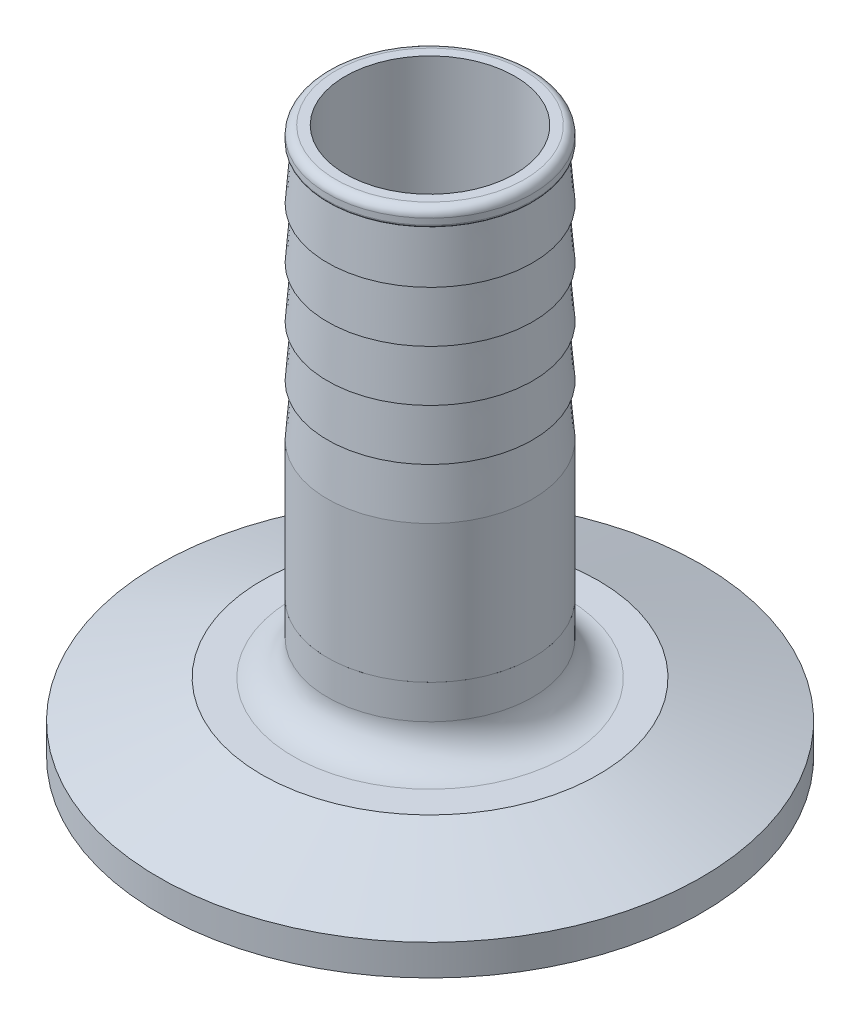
ISO-10303-21;
HEADER;
FILE_DESCRIPTION(('STEP AP214'),'2;1');
FILE_NAME('part.step','',(''),(''),'','','');
FILE_SCHEMA(('AUTOMOTIVE_DESIGN { 1 0 10303 214 1 1 1 1 }'));
ENDSEC;
DATA;
#1=APPLICATION_CONTEXT('core data for automotive mechanical design processes');
#2=APPLICATION_PROTOCOL_DEFINITION('international standard','automotive_design',2000,#1);
#3=PRODUCT_CONTEXT('',#1,'mechanical');
#4=PRODUCT('Part','Part','',(#3));
#5=PRODUCT_RELATED_PRODUCT_CATEGORY('part','',(#4));
#6=PRODUCT_DEFINITION_FORMATION('','',#4);
#7=PRODUCT_DEFINITION_CONTEXT('part definition',#1,'design');
#8=PRODUCT_DEFINITION('design','',#6,#7);
#9=PRODUCT_DEFINITION_SHAPE('','',#8);
#10=(LENGTH_UNIT() NAMED_UNIT(*) SI_UNIT(.MILLI.,.METRE.));
#11=(NAMED_UNIT(*) PLANE_ANGLE_UNIT() SI_UNIT($,.RADIAN.));
#12=(NAMED_UNIT(*) SI_UNIT($,.STERADIAN.) SOLID_ANGLE_UNIT());
#13=UNCERTAINTY_MEASURE_WITH_UNIT(LENGTH_MEASURE(1.E-05),#10,'distance_accuracy_value','');
#14=(GEOMETRIC_REPRESENTATION_CONTEXT(3) GLOBAL_UNCERTAINTY_ASSIGNED_CONTEXT((#13)) GLOBAL_UNIT_ASSIGNED_CONTEXT((#10,
#11,#12)) REPRESENTATION_CONTEXT('',''));
#15=CARTESIAN_POINT('',(0.,0.,0.));
#16=DIRECTION('',(0.,0.,1.));
#17=DIRECTION('',(1.,0.,0.));
#18=AXIS2_PLACEMENT_3D('',#15,#16,#17);
#19=CARTESIAN_POINT('',(32.9073264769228,33.0709293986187,40.1985314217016));
#20=DIRECTION('',(0.,-1.,0.));
#21=DIRECTION('',(-0.0101854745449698,0.,-0.999948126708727));
#22=AXIS2_PLACEMENT_3D('',#19,#20,#21);
#23=PLANE('',#22);
#24=CARTESIAN_POINT('',(23.3828206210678,33.0709293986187,40.2955480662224));
#25=DIRECTION('',(0.,-1.,0.));
#26=DIRECTION('',(-0.0101854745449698,0.,-0.999948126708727));
#27=AXIS2_PLACEMENT_3D('',#24,#25,#26);
#28=CIRCLE('',#27,7.874);
#29=CARTESIAN_POINT('',(23.3026201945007,33.0709293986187,32.4219565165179));
#30=VERTEX_POINT('',#29);
#31=EDGE_CURVE('P0_E67',#30,#30,#28,.T.);
#32=ORIENTED_EDGE('',*,*,#31,.F.);
#33=EDGE_LOOP('',(#32));
#34=FACE_BOUND('',#33,.T.);
#35=CARTESIAN_POINT('',(23.3828206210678,33.0709293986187,40.2955480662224));
#36=DIRECTION('',(0.,-1.,0.));
#37=DIRECTION('',(-0.0101854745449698,0.,-0.999948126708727));
#38=AXIS2_PLACEMENT_3D('',#35,#36,#37);
#39=CIRCLE('',#38,9.52499994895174);
#40=CARTESIAN_POINT('',(23.2858039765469,33.0709293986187,30.7710422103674));
#41=VERTEX_POINT('',#40);
#42=EDGE_CURVE('P0_E9',#41,#41,#39,.T.);
#43=ORIENTED_EDGE('',*,*,#42,.T.);
#44=EDGE_LOOP('',(#43));
#45=FACE_BOUND('',#44,.T.);
#46=ADVANCED_FACE('P0_F14',(#34,#45),#23,.T.);
#47=CARTESIAN_POINT('',(23.3828206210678,33.0709293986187,40.2955480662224));
#48=DIRECTION('',(0.,-1.,0.));
#49=DIRECTION('',(-0.0101854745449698,0.,-0.999948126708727));
#50=AXIS2_PLACEMENT_3D('',#47,#48,#49);
#51=CYLINDRICAL_SURFACE('',#50,9.52499994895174);
#52=CARTESIAN_POINT('',(23.3828206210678,45.8471293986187,40.2955480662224));
#53=DIRECTION('',(0.,-1.,0.));
#54=DIRECTION('',(-0.0101854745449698,0.,-0.999948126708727));
#55=AXIS2_PLACEMENT_3D('',#52,#53,#54);
#56=CIRCLE('',#55,9.52499994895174);
#57=CARTESIAN_POINT('',(23.2858039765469,45.8471293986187,30.7710422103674));
#58=VERTEX_POINT('',#57);
#59=EDGE_CURVE('P0_E20',#58,#58,#56,.T.);
#60=ORIENTED_EDGE('',*,*,#59,.T.);
#61=EDGE_LOOP('',(#60));
#62=FACE_BOUND('',#61,.T.);
#63=ORIENTED_EDGE('',*,*,#42,.F.);
#64=EDGE_LOOP('',(#63));
#65=FACE_BOUND('',#64,.T.);
#66=ADVANCED_FACE('P0_F83',(#62,#65),#51,.T.);
#67=CARTESIAN_POINT('',(23.3828206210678,45.8471293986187,40.2955480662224));
#68=DIRECTION('',(0.,-1.,0.));
#69=DIRECTION('',(-0.0101854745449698,0.,-0.999948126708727));
#70=AXIS2_PLACEMENT_3D('',#67,#68,#69);
#71=CONICAL_SURFACE('',#70,9.52499994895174,0.0800425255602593);
#72=CARTESIAN_POINT('',(23.3828206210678,50.5969293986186,40.2955480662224));
#73=DIRECTION('',(0.,-1.,0.));
#74=DIRECTION('',(-0.0101854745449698,0.,-0.999948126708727));
#75=AXIS2_PLACEMENT_3D('',#72,#73,#74);
#76=CIRCLE('',#75,9.14399994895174);
#77=CARTESIAN_POINT('',(23.2896846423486,50.5969293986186,31.1520224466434));
#78=VERTEX_POINT('',#77);
#79=EDGE_CURVE('P0_E24',#78,#78,#76,.T.);
#80=ORIENTED_EDGE('',*,*,#79,.T.);
#81=EDGE_LOOP('',(#80));
#82=FACE_BOUND('',#81,.T.);
#83=ORIENTED_EDGE('',*,*,#59,.F.);
#84=EDGE_LOOP('',(#83));
#85=FACE_BOUND('',#84,.T.);
#86=ADVANCED_FACE('P0_F88',(#82,#85),#71,.T.);
#87=CARTESIAN_POINT('',(32.9073264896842,50.5969293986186,40.1985314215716));
#88=DIRECTION('',(0.,-1.,0.));
#89=DIRECTION('',(-0.0101854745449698,0.,-0.999948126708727));
#90=AXIS2_PLACEMENT_3D('',#87,#88,#89);
#91=PLANE('',#90);
#92=CARTESIAN_POINT('',(23.3828206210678,50.5969293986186,40.2955480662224));
#93=DIRECTION('',(0.,-1.,0.));
#94=DIRECTION('',(-0.0101854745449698,0.,-0.999948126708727));
#95=AXIS2_PLACEMENT_3D('',#92,#93,#94);
#96=CIRCLE('',#95,9.5249999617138);
#97=CARTESIAN_POINT('',(23.285803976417,50.5969293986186,30.771042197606));
#98=VERTEX_POINT('',#97);
#99=EDGE_CURVE('P0_E28',#98,#98,#96,.T.);
#100=ORIENTED_EDGE('',*,*,#99,.T.);
#101=EDGE_LOOP('',(#100));
#102=FACE_BOUND('',#101,.T.);
#103=ORIENTED_EDGE('',*,*,#79,.F.);
#104=EDGE_LOOP('',(#103));
#105=FACE_BOUND('',#104,.T.);
#106=ADVANCED_FACE('P0_F92',(#102,#105),#91,.T.);
#107=CARTESIAN_POINT('',(23.3828206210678,50.5969293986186,40.2955480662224));
#108=DIRECTION('',(0.,-1.,0.));
#109=DIRECTION('',(-0.0101854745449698,0.,-0.999948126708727));
#110=AXIS2_PLACEMENT_3D('',#107,#108,#109);
#111=CONICAL_SURFACE('',#110,9.5249999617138,0.0800425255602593);
#112=CARTESIAN_POINT('',(23.3828206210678,55.3467293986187,40.2955480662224));
#113=DIRECTION('',(0.,-1.,0.));
#114=DIRECTION('',(-0.0101854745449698,0.,-0.999948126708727));
#115=AXIS2_PLACEMENT_3D('',#112,#113,#114);
#116=CIRCLE('',#115,9.1439999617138);
#117=CARTESIAN_POINT('',(23.2896846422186,55.3467293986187,31.1520224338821));
#118=VERTEX_POINT('',#117);
#119=EDGE_CURVE('P0_E33',#118,#118,#116,.T.);
#120=ORIENTED_EDGE('',*,*,#119,.T.);
#121=EDGE_LOOP('',(#120));
#122=FACE_BOUND('',#121,.T.);
#123=ORIENTED_EDGE('',*,*,#99,.F.);
#124=EDGE_LOOP('',(#123));
#125=FACE_BOUND('',#124,.T.);
#126=ADVANCED_FACE('P0_F99',(#122,#125),#111,.T.);
#127=CARTESIAN_POINT('',(32.9073265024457,55.3467293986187,40.1985314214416));
#128=DIRECTION('',(0.,-1.,0.));
#129=DIRECTION('',(-0.0101854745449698,0.,-0.999948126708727));
#130=AXIS2_PLACEMENT_3D('',#127,#128,#129);
#131=PLANE('',#130);
#132=CARTESIAN_POINT('',(23.3828206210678,55.3467293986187,40.2955480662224));
#133=DIRECTION('',(0.,-1.,0.));
#134=DIRECTION('',(-0.0101854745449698,0.,-0.999948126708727));
#135=AXIS2_PLACEMENT_3D('',#132,#133,#134);
#136=CIRCLE('',#135,9.52499997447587);
#137=CARTESIAN_POINT('',(23.285803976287,55.3467293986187,30.7710421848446));
#138=VERTEX_POINT('',#137);
#139=EDGE_CURVE('P0_E36',#138,#138,#136,.T.);
#140=ORIENTED_EDGE('',*,*,#139,.T.);
#141=EDGE_LOOP('',(#140));
#142=FACE_BOUND('',#141,.T.);
#143=ORIENTED_EDGE('',*,*,#119,.F.);
#144=EDGE_LOOP('',(#143));
#145=FACE_BOUND('',#144,.T.);
#146=ADVANCED_FACE('P0_F103',(#142,#145),#131,.T.);
#147=CARTESIAN_POINT('',(23.3828206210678,55.3467293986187,40.2955480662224));
#148=DIRECTION('',(0.,-1.,0.));
#149=DIRECTION('',(-0.0101854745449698,0.,-0.999948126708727));
#150=AXIS2_PLACEMENT_3D('',#147,#148,#149);
#151=CONICAL_SURFACE('',#150,9.52499997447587,0.0800425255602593);
#152=CARTESIAN_POINT('',(23.3828206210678,60.0965293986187,40.2955480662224));
#153=DIRECTION('',(0.,-1.,0.));
#154=DIRECTION('',(-0.0101854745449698,0.,-0.999948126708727));
#155=AXIS2_PLACEMENT_3D('',#152,#153,#154);
#156=CIRCLE('',#155,9.14399997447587);
#157=CARTESIAN_POINT('',(23.2896846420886,60.0965293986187,31.1520224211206));
#158=VERTEX_POINT('',#157);
#159=EDGE_CURVE('P0_E39',#158,#158,#156,.T.);
#160=ORIENTED_EDGE('',*,*,#159,.T.);
#161=EDGE_LOOP('',(#160));
#162=FACE_BOUND('',#161,.T.);
#163=ORIENTED_EDGE('',*,*,#139,.F.);
#164=EDGE_LOOP('',(#163));
#165=FACE_BOUND('',#164,.T.);
#166=ADVANCED_FACE('P0_F107',(#162,#165),#151,.T.);
#167=CARTESIAN_POINT('',(32.9073265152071,60.0965293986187,40.1985314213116));
#168=DIRECTION('',(0.,-1.,0.));
#169=DIRECTION('',(-0.0101854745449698,0.,-0.999948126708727));
#170=AXIS2_PLACEMENT_3D('',#167,#168,#169);
#171=PLANE('',#170);
#172=CARTESIAN_POINT('',(23.3828206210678,60.0965293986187,40.2955480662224));
#173=DIRECTION('',(0.,-1.,0.));
#174=DIRECTION('',(-0.0101854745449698,0.,-0.999948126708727));
#175=AXIS2_PLACEMENT_3D('',#172,#173,#174);
#176=CIRCLE('',#175,9.52499998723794);
#177=CARTESIAN_POINT('',(23.285803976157,60.0965293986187,30.7710421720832));
#178=VERTEX_POINT('',#177);
#179=EDGE_CURVE('P0_E42',#178,#178,#176,.T.);
#180=ORIENTED_EDGE('',*,*,#179,.T.);
#181=EDGE_LOOP('',(#180));
#182=FACE_BOUND('',#181,.T.);
#183=ORIENTED_EDGE('',*,*,#159,.F.);
#184=EDGE_LOOP('',(#183));
#185=FACE_BOUND('',#184,.T.);
#186=ADVANCED_FACE('P0_F111',(#182,#185),#171,.T.);
#187=CARTESIAN_POINT('',(23.3828206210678,60.0965293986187,40.2955480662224));
#188=DIRECTION('',(0.,-1.,0.));
#189=DIRECTION('',(-0.0101854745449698,0.,-0.999948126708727));
#190=AXIS2_PLACEMENT_3D('',#187,#188,#189);
#191=CONICAL_SURFACE('',#190,9.52499998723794,0.0800425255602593);
#192=CARTESIAN_POINT('',(23.3828206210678,64.8463293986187,40.2955480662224));
#193=DIRECTION('',(0.,-1.,0.));
#194=DIRECTION('',(-0.0101854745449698,0.,-0.999948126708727));
#195=AXIS2_PLACEMENT_3D('',#192,#193,#194);
#196=CIRCLE('',#195,9.14399998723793);
#197=CARTESIAN_POINT('',(23.2896846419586,64.8463293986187,31.1520224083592));
#198=VERTEX_POINT('',#197);
#199=EDGE_CURVE('P0_E45',#198,#198,#196,.T.);
#200=ORIENTED_EDGE('',*,*,#199,.T.);
#201=EDGE_LOOP('',(#200));
#202=FACE_BOUND('',#201,.T.);
#203=ORIENTED_EDGE('',*,*,#179,.F.);
#204=EDGE_LOOP('',(#203));
#205=FACE_BOUND('',#204,.T.);
#206=ADVANCED_FACE('P0_F115',(#202,#205),#191,.T.);
#207=CARTESIAN_POINT('',(32.9073265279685,64.8463293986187,40.1985314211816));
#208=DIRECTION('',(0.,-1.,0.));
#209=DIRECTION('',(-0.0101854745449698,0.,-0.999948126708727));
#210=AXIS2_PLACEMENT_3D('',#207,#208,#209);
#211=PLANE('',#210);
#212=CARTESIAN_POINT('',(23.3828206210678,64.8463293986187,40.2955480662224));
#213=DIRECTION('',(0.,-1.,0.));
#214=DIRECTION('',(-0.0101854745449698,0.,-0.999948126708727));
#215=AXIS2_PLACEMENT_3D('',#212,#213,#214);
#216=CIRCLE('',#215,9.525);
#217=CARTESIAN_POINT('',(23.285803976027,64.8463293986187,30.7710421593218));
#218=VERTEX_POINT('',#217);
#219=EDGE_CURVE('P0_E48',#218,#218,#216,.T.);
#220=ORIENTED_EDGE('',*,*,#219,.T.);
#221=EDGE_LOOP('',(#220));
#222=FACE_BOUND('',#221,.T.);
#223=ORIENTED_EDGE('',*,*,#199,.F.);
#224=EDGE_LOOP('',(#223));
#225=FACE_BOUND('',#224,.T.);
#226=ADVANCED_FACE('P0_F119',(#222,#225),#211,.T.);
#227=CARTESIAN_POINT('',(23.3828206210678,64.8463293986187,40.2955480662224));
#228=DIRECTION('',(0.,-1.,0.));
#229=DIRECTION('',(-0.0101854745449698,0.,-0.999948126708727));
#230=AXIS2_PLACEMENT_3D('',#227,#228,#229);
#231=CONICAL_SURFACE('',#230,9.525,0.0800425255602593);
#232=CARTESIAN_POINT('',(23.3828206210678,69.5961293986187,40.2955480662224));
#233=DIRECTION('',(0.,-1.,0.));
#234=DIRECTION('',(-0.0101854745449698,0.,-0.999948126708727));
#235=AXIS2_PLACEMENT_3D('',#232,#233,#234);
#236=CIRCLE('',#235,9.144);
#237=CARTESIAN_POINT('',(23.2896846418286,69.5961293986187,31.1520223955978));
#238=VERTEX_POINT('',#237);
#239=EDGE_CURVE('P0_E51',#238,#238,#236,.T.);
#240=ORIENTED_EDGE('',*,*,#239,.T.);
#241=EDGE_LOOP('',(#240));
#242=FACE_BOUND('',#241,.T.);
#243=ORIENTED_EDGE('',*,*,#219,.F.);
#244=EDGE_LOOP('',(#243));
#245=FACE_BOUND('',#244,.T.);
#246=ADVANCED_FACE('P0_F123',(#242,#245),#231,.T.);
#247=CARTESIAN_POINT('',(32.6533397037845,69.5961293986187,40.201118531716));
#248=DIRECTION('',(0.,-1.,0.));
#249=DIRECTION('',(-0.0101854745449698,0.,-0.999948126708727));
#250=AXIS2_PLACEMENT_3D('',#247,#248,#249);
#251=PLANE('',#250);
#252=CARTESIAN_POINT('',(23.3828206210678,69.5961293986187,40.2955480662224));
#253=DIRECTION('',(0.,-1.,0.));
#254=DIRECTION('',(-0.0101854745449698,0.,-0.999948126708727));
#255=AXIS2_PLACEMENT_3D('',#252,#253,#254);
#256=CIRCLE('',#255,9.27100000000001);
#257=CARTESIAN_POINT('',(23.2883910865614,69.5961293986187,31.0250289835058));
#258=VERTEX_POINT('',#257);
#259=EDGE_CURVE('P0_E54',#258,#258,#256,.T.);
#260=ORIENTED_EDGE('',*,*,#259,.T.);
#261=EDGE_LOOP('',(#260));
#262=FACE_BOUND('',#261,.T.);
#263=ORIENTED_EDGE('',*,*,#239,.F.);
#264=EDGE_LOOP('',(#263));
#265=FACE_BOUND('',#264,.T.);
#266=ADVANCED_FACE('P0_F127',(#262,#265),#251,.T.);
#267=CARTESIAN_POINT('',(23.3828206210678,69.8501293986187,40.2955480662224));
#268=DIRECTION('',(0.,-1.,0.));
#269=DIRECTION('',(-0.0101854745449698,0.,-0.999948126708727));
#270=AXIS2_PLACEMENT_3D('',#267,#268,#269);
#271=TOROIDAL_SURFACE('',#270,9.271,0.253999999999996);
#272=CARTESIAN_POINT('',(23.3828206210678,69.8501293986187,40.2955480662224));
#273=DIRECTION('',(0.,-1.,0.));
#274=DIRECTION('',(-0.0101854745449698,0.,-0.999948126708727));
#275=AXIS2_PLACEMENT_3D('',#272,#273,#274);
#276=CIRCLE('',#275,9.52499999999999);
#277=CARTESIAN_POINT('',(23.285803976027,69.8501293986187,30.7710421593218));
#278=VERTEX_POINT('',#277);
#279=EDGE_CURVE('P0_E57',#278,#278,#276,.T.);
#280=ORIENTED_EDGE('',*,*,#279,.T.);
#281=EDGE_LOOP('',(#280));
#282=FACE_BOUND('',#281,.T.);
#283=ORIENTED_EDGE('',*,*,#259,.F.);
#284=EDGE_LOOP('',(#283));
#285=FACE_BOUND('',#284,.T.);
#286=ADVANCED_FACE('P0_F131',(#282,#285),#271,.T.);
#287=CARTESIAN_POINT('',(23.3828206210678,33.0709293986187,40.2955480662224));
#288=DIRECTION('',(0.,-1.,0.));
#289=DIRECTION('',(-0.0101854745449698,0.,-0.999948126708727));
#290=AXIS2_PLACEMENT_3D('',#287,#288,#289);
#291=CYLINDRICAL_SURFACE('',#290,9.525);
#292=CARTESIAN_POINT('',(23.3828206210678,70.4089293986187,40.2955480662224));
#293=DIRECTION('',(0.,-1.,0.));
#294=DIRECTION('',(-0.0101854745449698,0.,-0.999948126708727));
#295=AXIS2_PLACEMENT_3D('',#292,#293,#294);
#296=CIRCLE('',#295,9.525);
#297=CARTESIAN_POINT('',(23.285803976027,70.4089293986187,30.7710421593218));
#298=VERTEX_POINT('',#297);
#299=EDGE_CURVE('P0_E60',#298,#298,#296,.T.);
#300=ORIENTED_EDGE('',*,*,#299,.T.);
#301=EDGE_LOOP('',(#300));
#302=FACE_BOUND('',#301,.T.);
#303=ORIENTED_EDGE('',*,*,#279,.F.);
#304=EDGE_LOOP('',(#303));
#305=FACE_BOUND('',#304,.T.);
#306=ADVANCED_FACE('P0_F135',(#302,#305),#291,.T.);
#307=CARTESIAN_POINT('',(23.3828206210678,70.4089293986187,40.2955480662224));
#308=DIRECTION('',(0.,-1.,0.));
#309=DIRECTION('',(-0.0101854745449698,0.,-0.999948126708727));
#310=AXIS2_PLACEMENT_3D('',#307,#308,#309);
#311=TOROIDAL_SURFACE('',#310,8.763,0.762000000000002);
#312=CARTESIAN_POINT('',(23.3828206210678,71.1709293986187,40.2955480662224));
#313=DIRECTION('',(0.,-1.,0.));
#314=DIRECTION('',(-0.0101854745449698,0.,-0.999948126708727));
#315=AXIS2_PLACEMENT_3D('',#312,#313,#314);
#316=CIRCLE('',#315,8.763);
#317=CARTESIAN_POINT('',(23.2935653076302,71.1709293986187,31.5330026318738));
#318=VERTEX_POINT('',#317);
#319=EDGE_CURVE('P0_E63',#318,#318,#316,.T.);
#320=ORIENTED_EDGE('',*,*,#319,.T.);
#321=EDGE_LOOP('',(#320));
#322=FACE_BOUND('',#321,.T.);
#323=ORIENTED_EDGE('',*,*,#299,.F.);
#324=EDGE_LOOP('',(#323));
#325=FACE_BOUND('',#324,.T.);
#326=ADVANCED_FACE('P0_F139',(#322,#325),#311,.T.);
#327=CARTESIAN_POINT('',(23.3828206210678,71.1709293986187,40.2955480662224));
#328=DIRECTION('',(0.,1.,0.));
#329=DIRECTION('',(0.0101854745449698,0.,0.999948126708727));
#330=AXIS2_PLACEMENT_3D('',#327,#328,#329);
#331=PLANE('',#330);
#332=CARTESIAN_POINT('',(23.3828206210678,71.1709293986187,40.2955480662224));
#333=DIRECTION('',(0.,-1.,0.));
#334=DIRECTION('',(-0.0101854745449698,0.,-0.999948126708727));
#335=AXIS2_PLACEMENT_3D('',#332,#333,#334);
#336=CIRCLE('',#335,7.874);
#337=CARTESIAN_POINT('',(23.3026201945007,71.1709293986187,32.4219565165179));
#338=VERTEX_POINT('',#337);
#339=EDGE_CURVE('P0_E66',#338,#338,#336,.T.);
#340=ORIENTED_EDGE('',*,*,#339,.T.);
#341=EDGE_LOOP('',(#340));
#342=FACE_BOUND('',#341,.T.);
#343=ORIENTED_EDGE('',*,*,#319,.F.);
#344=EDGE_LOOP('',(#343));
#345=FACE_BOUND('',#344,.T.);
#346=ADVANCED_FACE('P0_F73',(#342,#345),#331,.T.);
#347=CARTESIAN_POINT('',(23.3828206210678,71.1709293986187,40.2955480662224));
#348=DIRECTION('',(0.,-1.,0.));
#349=DIRECTION('',(-0.0101854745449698,0.,-0.999948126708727));
#350=AXIS2_PLACEMENT_3D('',#347,#348,#349);
#351=CYLINDRICAL_SURFACE('',#350,7.874);
#352=ORIENTED_EDGE('',*,*,#339,.F.);
#353=EDGE_LOOP('',(#352));
#354=FACE_BOUND('',#353,.T.);
#355=ORIENTED_EDGE('',*,*,#31,.T.);
#356=EDGE_LOOP('',(#355));
#357=FACE_BOUND('',#356,.T.);
#358=ADVANCED_FACE('P0_F76',(#354,#357),#351,.F.);
#359=CLOSED_SHELL('',(#46,#66,#86,#106,#126,#146,#166,#186,#206,#226,#246,#266,#286,#306,#326,
#346,#358));
#360=MANIFOLD_SOLID_BREP('P0_B1',#359);
#361=CARTESIAN_POINT('',(15.5088206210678,33.0709293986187,40.2955480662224));
#362=DIRECTION('',(0.,-1.,0.));
#363=DIRECTION('',(0.,0.,-1.));
#364=AXIS2_PLACEMENT_3D('',#361,#362,#363);
#365=PLANE('',#364);
#366=CARTESIAN_POINT('',(23.3828206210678,33.0709293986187,40.2955480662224));
#367=DIRECTION('',(0.,-1.,0.));
#368=DIRECTION('',(0.,0.,-1.));
#369=AXIS2_PLACEMENT_3D('',#366,#367,#368);
#370=CIRCLE('',#369,9.525);
#371=CARTESIAN_POINT('',(23.3828206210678,33.0709293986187,30.7705480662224));
#372=VERTEX_POINT('',#371);
#373=EDGE_CURVE('P1_E10',#372,#372,#370,.T.);
#374=ORIENTED_EDGE('',*,*,#373,.F.);
#375=EDGE_LOOP('',(#374));
#376=FACE_BOUND('',#375,.T.);
#377=CARTESIAN_POINT('',(23.3828206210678,33.0709293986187,40.2955480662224));
#378=DIRECTION('',(0.,-1.,0.));
#379=DIRECTION('',(0.,0.,-1.));
#380=AXIS2_PLACEMENT_3D('',#377,#378,#379);
#381=CIRCLE('',#380,7.874);
#382=CARTESIAN_POINT('',(23.3828206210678,33.0709293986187,32.4215480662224));
#383=VERTEX_POINT('',#382);
#384=EDGE_CURVE('P1_E64',#383,#383,#381,.T.);
#385=ORIENTED_EDGE('',*,*,#384,.T.);
#386=EDGE_LOOP('',(#385));
#387=FACE_BOUND('',#386,.T.);
#388=ADVANCED_FACE('P1_F15',(#376,#387),#365,.F.);
#389=CARTESIAN_POINT('',(23.3828206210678,20.3709293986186,40.2955480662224));
#390=DIRECTION('',(0.,-1.,0.));
#391=DIRECTION('',(0.,0.,-1.));
#392=AXIS2_PLACEMENT_3D('',#389,#390,#391);
#393=CYLINDRICAL_SURFACE('',#392,9.525);
#394=CARTESIAN_POINT('',(23.3828206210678,29.8959293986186,40.2955480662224));
#395=DIRECTION('',(0.,-1.,0.));
#396=DIRECTION('',(0.,0.,-1.));
#397=AXIS2_PLACEMENT_3D('',#394,#395,#396);
#398=CIRCLE('',#397,9.525);
#399=CARTESIAN_POINT('',(23.3828206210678,29.8959293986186,30.7705480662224));
#400=VERTEX_POINT('',#399);
#401=EDGE_CURVE('P1_E21',#400,#400,#398,.T.);
#402=ORIENTED_EDGE('',*,*,#401,.F.);
#403=EDGE_LOOP('',(#402));
#404=FACE_BOUND('',#403,.T.);
#405=ORIENTED_EDGE('',*,*,#373,.T.);
#406=EDGE_LOOP('',(#405));
#407=FACE_BOUND('',#406,.T.);
#408=ADVANCED_FACE('P1_F143',(#404,#407),#393,.T.);
#409=CARTESIAN_POINT('',(23.3828206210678,29.8959293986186,40.2955480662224));
#410=DIRECTION('',(0.,-1.,0.));
#411=DIRECTION('',(0.,0.,-1.));
#412=AXIS2_PLACEMENT_3D('',#409,#410,#411);
#413=TOROIDAL_SURFACE('',#412,12.7,3.175);
#414=CARTESIAN_POINT('',(23.3828206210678,26.7209293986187,40.2955480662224));
#415=DIRECTION('',(0.,-1.,0.));
#416=DIRECTION('',(0.,0.,-1.));
#417=AXIS2_PLACEMENT_3D('',#414,#415,#416);
#418=CIRCLE('',#417,12.7);
#419=CARTESIAN_POINT('',(23.3828206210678,26.7209293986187,27.5955480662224));
#420=VERTEX_POINT('',#419);
#421=EDGE_CURVE('P1_E25',#420,#420,#418,.T.);
#422=ORIENTED_EDGE('',*,*,#421,.F.);
#423=EDGE_LOOP('',(#422));
#424=FACE_BOUND('',#423,.T.);
#425=ORIENTED_EDGE('',*,*,#401,.T.);
#426=EDGE_LOOP('',(#425));
#427=FACE_BOUND('',#426,.T.);
#428=ADVANCED_FACE('P1_F138',(#424,#427),#413,.F.);
#429=CARTESIAN_POINT('',(10.6828206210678,26.7209293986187,40.2955480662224));
#430=DIRECTION('',(0.,-1.,0.));
#431=DIRECTION('',(0.,0.,-1.));
#432=AXIS2_PLACEMENT_3D('',#429,#430,#431);
#433=PLANE('',#432);
#434=CARTESIAN_POINT('',(23.3828206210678,26.7209293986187,40.2955480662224));
#435=DIRECTION('',(0.,-1.,0.));
#436=DIRECTION('',(0.,0.,-1.));
#437=AXIS2_PLACEMENT_3D('',#434,#435,#436);
#438=CIRCLE('',#437,15.6301961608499);
#439=CARTESIAN_POINT('',(23.3828206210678,26.7209293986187,24.6653519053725));
#440=VERTEX_POINT('',#439);
#441=EDGE_CURVE('P1_E29',#440,#440,#438,.T.);
#442=ORIENTED_EDGE('',*,*,#441,.F.);
#443=EDGE_LOOP('',(#442));
#444=FACE_BOUND('',#443,.T.);
#445=ORIENTED_EDGE('',*,*,#421,.T.);
#446=EDGE_LOOP('',(#445));
#447=FACE_BOUND('',#446,.T.);
#448=ADVANCED_FACE('P1_F132',(#444,#447),#433,.F.);
#449=CARTESIAN_POINT('',(23.3828206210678,26.7209293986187,40.2955480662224));
#450=DIRECTION('',(0.,-1.,0.));
#451=DIRECTION('',(0.,0.,-1.));
#452=AXIS2_PLACEMENT_3D('',#449,#450,#451);
#453=CONICAL_SURFACE('',#452,15.6301961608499,1.22173047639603);
#454=CARTESIAN_POINT('',(23.3828206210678,23.2389703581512,40.2955480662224));
#455=DIRECTION('',(0.,-1.,0.));
#456=DIRECTION('',(0.,0.,-1.));
#457=AXIS2_PLACEMENT_3D('',#454,#455,#456);
#458=CIRCLE('',#457,25.1968);
#459=CARTESIAN_POINT('',(23.3828206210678,23.2389703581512,15.0987480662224));
#460=VERTEX_POINT('',#459);
#461=EDGE_CURVE('P1_E34',#460,#460,#458,.T.);
#462=ORIENTED_EDGE('',*,*,#461,.F.);
#463=EDGE_LOOP('',(#462));
#464=FACE_BOUND('',#463,.T.);
#465=ORIENTED_EDGE('',*,*,#441,.T.);
#466=EDGE_LOOP('',(#465));
#467=FACE_BOUND('',#466,.T.);
#468=ADVANCED_FACE('P1_F126',(#464,#467),#453,.T.);
#469=CARTESIAN_POINT('',(23.3828206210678,20.3709293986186,40.2955480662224));
#470=DIRECTION('',(0.,-1.,0.));
#471=DIRECTION('',(0.,0.,-1.));
#472=AXIS2_PLACEMENT_3D('',#469,#470,#471);
#473=CYLINDRICAL_SURFACE('',#472,25.1968);
#474=CARTESIAN_POINT('',(23.3828206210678,20.3709293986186,40.2955480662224));
#475=DIRECTION('',(0.,-1.,0.));
#476=DIRECTION('',(0.,0.,-1.));
#477=AXIS2_PLACEMENT_3D('',#474,#475,#476);
#478=CIRCLE('',#477,25.1968);
#479=CARTESIAN_POINT('',(23.3828206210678,20.3709293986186,15.0987480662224));
#480=VERTEX_POINT('',#479);
#481=EDGE_CURVE('P1_E37',#480,#480,#478,.T.);
#482=ORIENTED_EDGE('',*,*,#481,.F.);
#483=EDGE_LOOP('',(#482));
#484=FACE_BOUND('',#483,.T.);
#485=ORIENTED_EDGE('',*,*,#461,.T.);
#486=EDGE_LOOP('',(#485));
#487=FACE_BOUND('',#486,.T.);
#488=ADVANCED_FACE('P1_F120',(#484,#487),#473,.T.);
#489=CARTESIAN_POINT('',(-1.81397937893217,20.3709293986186,40.2955480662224));
#490=DIRECTION('',(0.,1.,0.));
#491=DIRECTION('',(0.,0.,1.));
#492=AXIS2_PLACEMENT_3D('',#489,#490,#491);
#493=PLANE('',#492);
#494=CARTESIAN_POINT('',(23.3828206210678,20.3709293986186,40.2955480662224));
#495=DIRECTION('',(0.,-1.,0.));
#496=DIRECTION('',(0.,0.,-1.));
#497=AXIS2_PLACEMENT_3D('',#494,#495,#496);
#498=CIRCLE('',#497,23.8091722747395);
#499=CARTESIAN_POINT('',(23.3828206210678,20.3709293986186,16.4863757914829));
#500=VERTEX_POINT('',#499);
#501=EDGE_CURVE('P1_E40',#500,#500,#498,.T.);
#502=ORIENTED_EDGE('',*,*,#501,.F.);
#503=EDGE_LOOP('',(#502));
#504=FACE_BOUND('',#503,.T.);
#505=ORIENTED_EDGE('',*,*,#481,.T.);
#506=EDGE_LOOP('',(#505));
#507=FACE_BOUND('',#506,.T.);
#508=ADVANCED_FACE('P1_F114',(#504,#507),#493,.F.);
#509=CARTESIAN_POINT('',(23.3828206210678,21.1583293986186,40.2955480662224));
#510=DIRECTION('',(0.,-1.,0.));
#511=DIRECTION('',(0.,0.,-1.));
#512=AXIS2_PLACEMENT_3D('',#509,#510,#511);
#513=TOROIDAL_SURFACE('',#512,23.8091722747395,0.787399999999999);
#514=CARTESIAN_POINT('',(23.3828206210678,20.8506677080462,40.2955480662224));
#515=DIRECTION('',(0.,-1.,0.));
#516=DIRECTION('',(0.,0.,-1.));
#517=AXIS2_PLACEMENT_3D('',#514,#515,#516);
#518=CIRCLE('',#517,23.0843667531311);
#519=CARTESIAN_POINT('',(23.3828206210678,20.8506677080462,17.2111813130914));
#520=VERTEX_POINT('',#519);
#521=EDGE_CURVE('P1_E43',#520,#520,#518,.T.);
#522=ORIENTED_EDGE('',*,*,#521,.F.);
#523=EDGE_LOOP('',(#522));
#524=FACE_BOUND('',#523,.T.);
#525=ORIENTED_EDGE('',*,*,#501,.T.);
#526=EDGE_LOOP('',(#525));
#527=FACE_BOUND('',#526,.T.);
#528=ADVANCED_FACE('P1_F108',(#524,#527),#513,.T.);
#529=CARTESIAN_POINT('',(23.3828206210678,20.8506677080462,40.2955480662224));
#530=DIRECTION('',(0.,-1.,0.));
#531=DIRECTION('',(0.,0.,-1.));
#532=AXIS2_PLACEMENT_3D('',#529,#530,#531);
#533=CONICAL_SURFACE('',#532,23.0843667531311,0.401425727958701);
#534=CARTESIAN_POINT('',(23.3828206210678,21.2437842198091,40.2955480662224));
#535=DIRECTION('',(0.,-1.,0.));
#536=DIRECTION('',(0.,0.,-1.));
#537=AXIS2_PLACEMENT_3D('',#534,#535,#536);
#538=CIRCLE('',#537,22.9174986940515);
#539=CARTESIAN_POINT('',(23.3828206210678,21.2437842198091,17.3780493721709));
#540=VERTEX_POINT('',#539);
#541=EDGE_CURVE('P1_E46',#540,#540,#538,.T.);
#542=ORIENTED_EDGE('',*,*,#541,.F.);
#543=EDGE_LOOP('',(#542));
#544=FACE_BOUND('',#543,.T.);
#545=ORIENTED_EDGE('',*,*,#521,.T.);
#546=EDGE_LOOP('',(#545));
#547=FACE_BOUND('',#546,.T.);
#548=ADVANCED_FACE('P1_F102',(#544,#547),#533,.F.);
#549=CARTESIAN_POINT('',(23.3828206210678,20.7773293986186,40.2955480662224));
#550=DIRECTION('',(0.,-1.,0.));
#551=DIRECTION('',(0.,0.,-1.));
#552=AXIS2_PLACEMENT_3D('',#549,#550,#551);
#553=TOROIDAL_SURFACE('',#552,21.8186,1.1938);
#554=CARTESIAN_POINT('',(23.3828206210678,21.2437842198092,40.2955480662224));
#555=DIRECTION('',(0.,-1.,0.));
#556=DIRECTION('',(0.,0.,-1.));
#557=AXIS2_PLACEMENT_3D('',#554,#555,#556);
#558=CIRCLE('',#557,20.7197013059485);
#559=CARTESIAN_POINT('',(23.3828206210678,21.2437842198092,19.5758467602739));
#560=VERTEX_POINT('',#559);
#561=EDGE_CURVE('P1_E49',#560,#560,#558,.T.);
#562=ORIENTED_EDGE('',*,*,#561,.F.);
#563=EDGE_LOOP('',(#562));
#564=FACE_BOUND('',#563,.T.);
#565=ORIENTED_EDGE('',*,*,#541,.T.);
#566=EDGE_LOOP('',(#565));
#567=FACE_BOUND('',#566,.T.);
#568=ADVANCED_FACE('P1_F96',(#564,#567),#553,.F.);
#569=CARTESIAN_POINT('',(23.3828206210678,21.2437842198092,40.2955480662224));
#570=DIRECTION('',(0.,1.,0.));
#571=DIRECTION('',(0.,0.,1.));
#572=AXIS2_PLACEMENT_3D('',#569,#570,#571);
#573=CONICAL_SURFACE('',#572,20.7197013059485,0.401425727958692);
#574=CARTESIAN_POINT('',(23.3828206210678,20.8506677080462,40.2955480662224));
#575=DIRECTION('',(0.,-1.,0.));
#576=DIRECTION('',(0.,0.,-1.));
#577=AXIS2_PLACEMENT_3D('',#574,#575,#576);
#578=CIRCLE('',#577,20.5528332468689);
#579=CARTESIAN_POINT('',(23.3828206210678,20.8506677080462,19.7427148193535));
#580=VERTEX_POINT('',#579);
#581=EDGE_CURVE('P1_E52',#580,#580,#578,.T.);
#582=ORIENTED_EDGE('',*,*,#581,.F.);
#583=EDGE_LOOP('',(#582));
#584=FACE_BOUND('',#583,.T.);
#585=ORIENTED_EDGE('',*,*,#561,.T.);
#586=EDGE_LOOP('',(#585));
#587=FACE_BOUND('',#586,.T.);
#588=ADVANCED_FACE('P1_F90',(#584,#587),#573,.T.);
#589=CARTESIAN_POINT('',(23.3828206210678,21.1583293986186,40.2955480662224));
#590=DIRECTION('',(0.,-1.,0.));
#591=DIRECTION('',(0.,0.,-1.));
#592=AXIS2_PLACEMENT_3D('',#589,#590,#591);
#593=TOROIDAL_SURFACE('',#592,19.8280277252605,0.787399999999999);
#594=CARTESIAN_POINT('',(23.3828206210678,20.3709293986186,40.2955480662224));
#595=DIRECTION('',(0.,-1.,0.));
#596=DIRECTION('',(0.,0.,-1.));
#597=AXIS2_PLACEMENT_3D('',#594,#595,#596);
#598=CIRCLE('',#597,19.8280277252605);
#599=CARTESIAN_POINT('',(23.3828206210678,20.3709293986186,20.4675203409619));
#600=VERTEX_POINT('',#599);
#601=EDGE_CURVE('P1_E55',#600,#600,#598,.T.);
#602=ORIENTED_EDGE('',*,*,#601,.F.);
#603=EDGE_LOOP('',(#602));
#604=FACE_BOUND('',#603,.T.);
#605=ORIENTED_EDGE('',*,*,#581,.T.);
#606=EDGE_LOOP('',(#605));
#607=FACE_BOUND('',#606,.T.);
#608=ADVANCED_FACE('P1_F84',(#604,#607),#593,.T.);
#609=CARTESIAN_POINT('',(3.55479289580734,20.3709293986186,40.2955480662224));
#610=DIRECTION('',(0.,1.,0.));
#611=DIRECTION('',(0.,0.,1.));
#612=AXIS2_PLACEMENT_3D('',#609,#610,#611);
#613=PLANE('',#612);
#614=CARTESIAN_POINT('',(23.3828206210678,20.3709293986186,40.2955480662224));
#615=DIRECTION('',(0.,-1.,0.));
#616=DIRECTION('',(0.,0.,-1.));
#617=AXIS2_PLACEMENT_3D('',#614,#615,#616);
#618=CIRCLE('',#617,11.049);
#619=CARTESIAN_POINT('',(23.3828206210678,20.3709293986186,29.2465480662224));
#620=VERTEX_POINT('',#619);
#621=EDGE_CURVE('P1_E58',#620,#620,#618,.T.);
#622=ORIENTED_EDGE('',*,*,#621,.F.);
#623=EDGE_LOOP('',(#622));
#624=FACE_BOUND('',#623,.T.);
#625=ORIENTED_EDGE('',*,*,#601,.T.);
#626=EDGE_LOOP('',(#625));
#627=FACE_BOUND('',#626,.T.);
#628=ADVANCED_FACE('P1_F78',(#624,#627),#613,.F.);
#629=CARTESIAN_POINT('',(23.3828206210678,20.3709293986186,40.2955480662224));
#630=DIRECTION('',(0.,-1.,0.));
#631=DIRECTION('',(0.,0.,-1.));
#632=AXIS2_PLACEMENT_3D('',#629,#630,#631);
#633=CONICAL_SURFACE('',#632,11.049,0.35116024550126);
#634=CARTESIAN_POINT('',(23.3828206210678,29.0376494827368,40.2955480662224));
#635=DIRECTION('',(0.,-1.,0.));
#636=DIRECTION('',(0.,0.,-1.));
#637=AXIS2_PLACEMENT_3D('',#634,#635,#636);
#638=CIRCLE('',#637,7.874);
#639=CARTESIAN_POINT('',(23.3828206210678,29.0376494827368,32.4215480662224));
#640=VERTEX_POINT('',#639);
#641=EDGE_CURVE('P1_E61',#640,#640,#638,.T.);
#642=ORIENTED_EDGE('',*,*,#641,.F.);
#643=EDGE_LOOP('',(#642));
#644=FACE_BOUND('',#643,.T.);
#645=ORIENTED_EDGE('',*,*,#621,.T.);
#646=EDGE_LOOP('',(#645));
#647=FACE_BOUND('',#646,.T.);
#648=ADVANCED_FACE('P1_F72',(#644,#647),#633,.F.);
#649=CARTESIAN_POINT('',(23.3828206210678,20.3709293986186,40.2955480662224));
#650=DIRECTION('',(0.,-1.,0.));
#651=DIRECTION('',(0.,0.,-1.));
#652=AXIS2_PLACEMENT_3D('',#649,#650,#651);
#653=CYLINDRICAL_SURFACE('',#652,7.874);
#654=ORIENTED_EDGE('',*,*,#384,.F.);
#655=EDGE_LOOP('',(#654));
#656=FACE_BOUND('',#655,.T.);
#657=ORIENTED_EDGE('',*,*,#641,.T.);
#658=EDGE_LOOP('',(#657));
#659=FACE_BOUND('',#658,.T.);
#660=ADVANCED_FACE('P1_F69',(#656,#659),#653,.F.);
#661=CLOSED_SHELL('',(#388,#408,#428,#448,#468,#488,#508,#528,#548,#568,#588,#608,#628,#648,#660));
#662=MANIFOLD_SOLID_BREP('P1_B1',#661);
#663=ADVANCED_BREP_SHAPE_REPRESENTATION('',(#18,#360,#662),#14);
#664=SHAPE_DEFINITION_REPRESENTATION(#9,#663);
ENDSEC;
END-ISO-10303-21;
